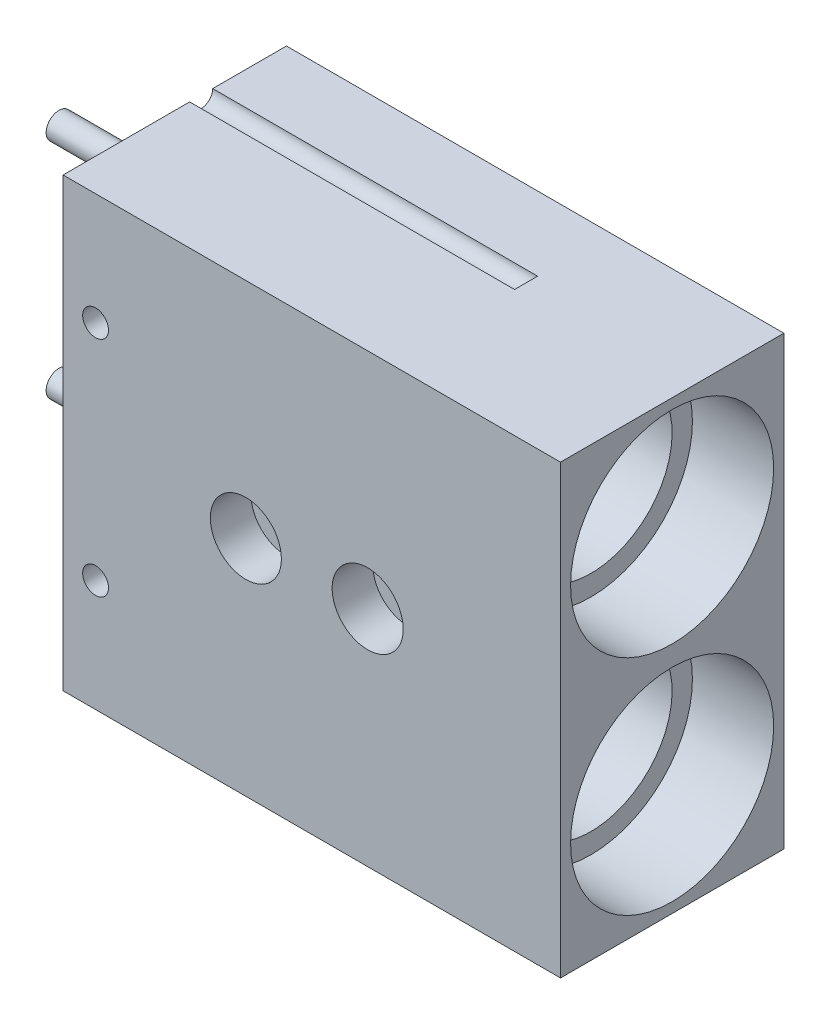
ISO-10303-21;
HEADER;
FILE_DESCRIPTION(('STEP AP214'),'2;1');
FILE_NAME('part.step','',(''),(''),'','','');
FILE_SCHEMA(('AUTOMOTIVE_DESIGN { 1 0 10303 214 1 1 1 1 }'));
ENDSEC;
DATA;
#1=APPLICATION_CONTEXT('core data for automotive mechanical design processes');
#2=APPLICATION_PROTOCOL_DEFINITION('international standard','automotive_design',2000,#1);
#3=PRODUCT_CONTEXT('',#1,'mechanical');
#4=PRODUCT('Part','Part','',(#3));
#5=PRODUCT_RELATED_PRODUCT_CATEGORY('part','',(#4));
#6=PRODUCT_DEFINITION_FORMATION('','',#4);
#7=PRODUCT_DEFINITION_CONTEXT('part definition',#1,'design');
#8=PRODUCT_DEFINITION('design','',#6,#7);
#9=PRODUCT_DEFINITION_SHAPE('','',#8);
#10=(LENGTH_UNIT() NAMED_UNIT(*) SI_UNIT(.MILLI.,.METRE.));
#11=(NAMED_UNIT(*) PLANE_ANGLE_UNIT() SI_UNIT($,.RADIAN.));
#12=(NAMED_UNIT(*) SI_UNIT($,.STERADIAN.) SOLID_ANGLE_UNIT());
#13=UNCERTAINTY_MEASURE_WITH_UNIT(LENGTH_MEASURE(1.E-05),#10,'distance_accuracy_value','');
#14=(GEOMETRIC_REPRESENTATION_CONTEXT(3) GLOBAL_UNCERTAINTY_ASSIGNED_CONTEXT((#13)) GLOBAL_UNIT_ASSIGNED_CONTEXT((#10,
#11,#12)) REPRESENTATION_CONTEXT('',''));
#15=CARTESIAN_POINT('',(0.,0.,0.));
#16=DIRECTION('',(0.,0.,1.));
#17=DIRECTION('',(1.,0.,0.));
#18=AXIS2_PLACEMENT_3D('',#15,#16,#17);
#19=CARTESIAN_POINT('',(-22.5966765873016,15.4214285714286,-34.925));
#20=DIRECTION('',(-1.,0.,0.));
#21=DIRECTION('',(0.,-1.,0.));
#22=AXIS2_PLACEMENT_3D('',#19,#20,#21);
#23=PLANE('',#22);
#24=CARTESIAN_POINT('',(-22.5966765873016,-2.04107142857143,-23.876));
#25=DIRECTION('',(-1.,0.,0.));
#26=DIRECTION('',(0.,-1.,0.));
#27=AXIS2_PLACEMENT_3D('',#24,#25,#26);
#28=CIRCLE('',#27,2.0193);
#29=CARTESIAN_POINT('',(-22.5966765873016,-4.06037142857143,-23.876));
#30=VERTEX_POINT('',#29);
#31=EDGE_CURVE('E179',#30,#30,#28,.T.);
#32=ORIENTED_EDGE('',*,*,#31,.F.);
#33=EDGE_LOOP('',(#32));
#34=FACE_BOUND('',#33,.T.);
#35=CARTESIAN_POINT('',(-22.5966765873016,-54.4285714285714,-21.59));
#36=DIRECTION('',(-1.,0.,0.));
#37=DIRECTION('',(0.,-1.,0.));
#38=AXIS2_PLACEMENT_3D('',#35,#36,#37);
#39=CIRCLE('',#38,1.8034);
#40=CARTESIAN_POINT('',(-22.5966765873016,-54.4285714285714,-19.7866));
#41=VERTEX_POINT('',#40);
#42=CARTESIAN_POINT('',(-22.5966765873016,-54.4285714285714,-23.3934));
#43=VERTEX_POINT('',#42);
#44=EDGE_CURVE('E115',#41,#43,#39,.T.);
#45=ORIENTED_EDGE('',*,*,#44,.F.);
#46=DIRECTION('',(0.,0.,1.));
#47=VECTOR('',#46,1.);
#48=CARTESIAN_POINT('',(-22.5966765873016,-54.4285714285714,-34.925));
#49=LINE('',#48,#47);
#50=CARTESIAN_POINT('',(-22.5966765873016,-54.4285714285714,0.));
#51=VERTEX_POINT('',#50);
#52=EDGE_CURVE('E124',#41,#51,#49,.T.);
#53=ORIENTED_EDGE('',*,*,#52,.T.);
#54=DIRECTION('',(0.,-1.,0.));
#55=VECTOR('',#54,1.);
#56=CARTESIAN_POINT('',(-22.5966765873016,15.4214285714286,0.));
#57=LINE('',#56,#55);
#58=CARTESIAN_POINT('',(-22.5966765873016,15.4214285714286,0.));
#59=VERTEX_POINT('',#58);
#60=EDGE_CURVE('E238',#59,#51,#57,.T.);
#61=ORIENTED_EDGE('',*,*,#60,.F.);
#62=DIRECTION('',(0.,0.,1.));
#63=VECTOR('',#62,1.);
#64=CARTESIAN_POINT('',(-22.5966765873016,15.4214285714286,-34.925));
#65=LINE('',#64,#63);
#66=CARTESIAN_POINT('',(-22.5966765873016,15.4214285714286,-19.7866));
#67=VERTEX_POINT('',#66);
#68=EDGE_CURVE('E255',#67,#59,#65,.T.);
#69=ORIENTED_EDGE('',*,*,#68,.F.);
#70=CARTESIAN_POINT('',(-22.5966765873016,15.4214285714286,-21.59));
#71=DIRECTION('',(-1.,0.,0.));
#72=DIRECTION('',(0.,-1.,0.));
#73=AXIS2_PLACEMENT_3D('',#70,#71,#72);
#74=CIRCLE('',#73,1.8034);
#75=CARTESIAN_POINT('',(-22.5966765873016,15.4214285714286,-23.3934));
#76=VERTEX_POINT('',#75);
#77=EDGE_CURVE('E186',#76,#67,#74,.T.);
#78=ORIENTED_EDGE('',*,*,#77,.F.);
#79=CARTESIAN_POINT('',(-22.5966765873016,15.4214285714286,-34.925));
#80=VERTEX_POINT('',#79);
#81=EDGE_CURVE('E147',#80,#76,#65,.T.);
#82=ORIENTED_EDGE('',*,*,#81,.F.);
#83=DIRECTION('',(0.,-1.,0.));
#84=VECTOR('',#83,1.);
#85=CARTESIAN_POINT('',(-22.5966765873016,15.4214285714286,-34.925));
#86=LINE('',#85,#84);
#87=CARTESIAN_POINT('',(-22.5966765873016,-54.4285714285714,-34.925));
#88=VERTEX_POINT('',#87);
#89=EDGE_CURVE('E239',#80,#88,#86,.T.);
#90=ORIENTED_EDGE('',*,*,#89,.T.);
#91=EDGE_CURVE('E127',#88,#43,#49,.T.);
#92=ORIENTED_EDGE('',*,*,#91,.T.);
#93=EDGE_LOOP('',(#45,#53,#61,#69,#78,#82,#90,#92));
#94=FACE_BOUND('',#93,.T.);
#95=CARTESIAN_POINT('',(-22.5966765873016,-36.9660714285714,-23.876));
#96=DIRECTION('',(-1.,0.,0.));
#97=DIRECTION('',(0.,-1.,0.));
#98=AXIS2_PLACEMENT_3D('',#95,#96,#97);
#99=CIRCLE('',#98,2.0193);
#100=CARTESIAN_POINT('',(-22.5966765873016,-38.9853714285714,-23.876));
#101=VERTEX_POINT('',#100);
#102=EDGE_CURVE('E175',#101,#101,#99,.T.);
#103=ORIENTED_EDGE('',*,*,#102,.F.);
#104=EDGE_LOOP('',(#103));
#105=FACE_BOUND('',#104,.T.);
#106=ADVANCED_FACE('F37',(#34,#94,#105),#23,.T.);
#107=CARTESIAN_POINT('',(-22.5966765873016,15.4214285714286,-34.925));
#108=DIRECTION('',(0.,1.,0.));
#109=DIRECTION('',(0.,0.,1.));
#110=AXIS2_PLACEMENT_3D('',#107,#108,#109);
#111=PLANE('',#110);
#112=DIRECTION('',(-1.,0.,0.));
#113=VECTOR('',#112,1.);
#114=CARTESIAN_POINT('',(28.2033234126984,15.4214285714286,-23.3934));
#115=LINE('',#114,#113);
#116=CARTESIAN_POINT('',(28.2033234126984,15.4214285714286,-23.3934));
#117=VERTEX_POINT('',#116);
#118=EDGE_CURVE('E149',#117,#76,#115,.T.);
#119=ORIENTED_EDGE('',*,*,#118,.F.);
#120=DIRECTION('',(0.,0.,1.));
#121=VECTOR('',#120,1.);
#122=CARTESIAN_POINT('',(28.2033234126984,15.4214285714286,-34.925));
#123=LINE('',#122,#121);
#124=CARTESIAN_POINT('',(28.2033234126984,15.4214285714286,-19.7866));
#125=VERTEX_POINT('',#124);
#126=EDGE_CURVE('E143',#117,#125,#123,.T.);
#127=ORIENTED_EDGE('',*,*,#126,.T.);
#128=DIRECTION('',(-1.,0.,0.));
#129=VECTOR('',#128,1.);
#130=CARTESIAN_POINT('',(28.2033234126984,15.4214285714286,-19.7866));
#131=LINE('',#130,#129);
#132=EDGE_CURVE('E146',#67,#125,#131,.F.);
#133=ORIENTED_EDGE('',*,*,#132,.F.);
#134=ORIENTED_EDGE('',*,*,#68,.T.);
#135=DIRECTION('',(-1.,0.,0.));
#136=VECTOR('',#135,1.);
#137=CARTESIAN_POINT('',(-22.5966765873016,15.4214285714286,0.));
#138=LINE('',#137,#136);
#139=CARTESIAN_POINT('',(55.1781234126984,15.4214285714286,0.));
#140=VERTEX_POINT('',#139);
#141=EDGE_CURVE('E242',#140,#59,#138,.T.);
#142=ORIENTED_EDGE('',*,*,#141,.F.);
#143=DIRECTION('',(0.,0.,1.));
#144=VECTOR('',#143,1.);
#145=CARTESIAN_POINT('',(55.1781234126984,15.4214285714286,-34.925));
#146=LINE('',#145,#144);
#147=CARTESIAN_POINT('',(55.1781234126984,15.4214285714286,-34.925));
#148=VERTEX_POINT('',#147);
#149=EDGE_CURVE('E256',#148,#140,#146,.T.);
#150=ORIENTED_EDGE('',*,*,#149,.F.);
#151=DIRECTION('',(-1.,0.,0.));
#152=VECTOR('',#151,1.);
#153=CARTESIAN_POINT('',(-22.5966765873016,15.4214285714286,-34.925));
#154=LINE('',#153,#152);
#155=EDGE_CURVE('E134',#148,#80,#154,.T.);
#156=ORIENTED_EDGE('',*,*,#155,.T.);
#157=ORIENTED_EDGE('',*,*,#81,.T.);
#158=EDGE_LOOP('',(#119,#127,#133,#134,#142,#150,#156,#157));
#159=FACE_BOUND('',#158,.T.);
#160=ADVANCED_FACE('F270',(#159),#111,.T.);
#161=CARTESIAN_POINT('',(55.1781234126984,15.4214285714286,-34.925));
#162=DIRECTION('',(1.,0.,0.));
#163=DIRECTION('',(0.,1.,0.));
#164=AXIS2_PLACEMENT_3D('',#161,#162,#163);
#165=PLANE('',#164);
#166=CARTESIAN_POINT('',(55.1781234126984,-36.9533714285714,-17.4498));
#167=DIRECTION('',(1.,0.,0.));
#168=DIRECTION('',(0.,1.,0.));
#169=AXIS2_PLACEMENT_3D('',#166,#167,#168);
#170=CIRCLE('',#169,15.875);
#171=CARTESIAN_POINT('',(55.1781234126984,-21.0783714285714,-17.4498));
#172=VERTEX_POINT('',#171);
#173=EDGE_CURVE('E170',#172,#172,#170,.T.);
#174=ORIENTED_EDGE('',*,*,#173,.F.);
#175=EDGE_LOOP('',(#174));
#176=FACE_BOUND('',#175,.T.);
#177=CARTESIAN_POINT('',(55.1781234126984,-2.05377142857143,-17.4498));
#178=DIRECTION('',(1.,0.,0.));
#179=DIRECTION('',(0.,1.,0.));
#180=AXIS2_PLACEMENT_3D('',#177,#178,#179);
#181=CIRCLE('',#180,15.875);
#182=CARTESIAN_POINT('',(55.1781234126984,13.8212285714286,-17.4498));
#183=VERTEX_POINT('',#182);
#184=EDGE_CURVE('E163',#183,#183,#181,.T.);
#185=ORIENTED_EDGE('',*,*,#184,.F.);
#186=EDGE_LOOP('',(#185));
#187=FACE_BOUND('',#186,.T.);
#188=DIRECTION('',(0.,1.,0.));
#189=VECTOR('',#188,1.);
#190=CARTESIAN_POINT('',(55.1781234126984,15.4214285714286,0.));
#191=LINE('',#190,#189);
#192=CARTESIAN_POINT('',(55.1781234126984,-54.4285714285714,0.));
#193=VERTEX_POINT('',#192);
#194=EDGE_CURVE('E249',#193,#140,#191,.T.);
#195=ORIENTED_EDGE('',*,*,#194,.F.);
#196=DIRECTION('',(0.,0.,1.));
#197=VECTOR('',#196,1.);
#198=CARTESIAN_POINT('',(55.1781234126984,-54.4285714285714,-34.925));
#199=LINE('',#198,#197);
#200=CARTESIAN_POINT('',(55.1781234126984,-54.4285714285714,-34.925));
#201=VERTEX_POINT('',#200);
#202=EDGE_CURVE('E136',#201,#193,#199,.T.);
#203=ORIENTED_EDGE('',*,*,#202,.F.);
#204=DIRECTION('',(0.,1.,0.));
#205=VECTOR('',#204,1.);
#206=CARTESIAN_POINT('',(55.1781234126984,15.4214285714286,-34.925));
#207=LINE('',#206,#205);
#208=EDGE_CURVE('E138',#201,#148,#207,.T.);
#209=ORIENTED_EDGE('',*,*,#208,.T.);
#210=ORIENTED_EDGE('',*,*,#149,.T.);
#211=EDGE_LOOP('',(#195,#203,#209,#210));
#212=FACE_BOUND('',#211,.T.);
#213=ADVANCED_FACE('F261',(#176,#187,#212),#165,.T.);
#214=CARTESIAN_POINT('',(-22.5966765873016,-54.4285714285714,-34.925));
#215=DIRECTION('',(0.,-1.,0.));
#216=DIRECTION('',(0.,0.,-1.));
#217=AXIS2_PLACEMENT_3D('',#214,#215,#216);
#218=PLANE('',#217);
#219=DIRECTION('',(-1.,0.,0.));
#220=VECTOR('',#219,1.);
#221=CARTESIAN_POINT('',(28.2033234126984,-54.4285714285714,-19.7866));
#222=LINE('',#221,#220);
#223=CARTESIAN_POINT('',(28.2033234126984,-54.4285714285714,-19.7866));
#224=VERTEX_POINT('',#223);
#225=EDGE_CURVE('E11',#224,#41,#222,.T.);
#226=ORIENTED_EDGE('',*,*,#225,.F.);
#227=DIRECTION('',(0.,0.,-1.));
#228=VECTOR('',#227,1.);
#229=CARTESIAN_POINT('',(28.2033234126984,-54.4285714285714,-34.925));
#230=LINE('',#229,#228);
#231=CARTESIAN_POINT('',(28.2033234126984,-54.4285714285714,-23.3934));
#232=VERTEX_POINT('',#231);
#233=EDGE_CURVE('E151',#224,#232,#230,.T.);
#234=ORIENTED_EDGE('',*,*,#233,.T.);
#235=DIRECTION('',(-1.,0.,0.));
#236=VECTOR('',#235,1.);
#237=CARTESIAN_POINT('',(28.2033234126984,-54.4285714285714,-23.3934));
#238=LINE('',#237,#236);
#239=EDGE_CURVE('E45',#43,#232,#238,.F.);
#240=ORIENTED_EDGE('',*,*,#239,.F.);
#241=ORIENTED_EDGE('',*,*,#91,.F.);
#242=DIRECTION('',(1.,0.,0.));
#243=VECTOR('',#242,1.);
#244=CARTESIAN_POINT('',(-22.5966765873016,-54.4285714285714,-34.925));
#245=LINE('',#244,#243);
#246=EDGE_CURVE('E241',#88,#201,#245,.T.);
#247=ORIENTED_EDGE('',*,*,#246,.T.);
#248=ORIENTED_EDGE('',*,*,#202,.T.);
#249=DIRECTION('',(1.,0.,0.));
#250=VECTOR('',#249,1.);
#251=CARTESIAN_POINT('',(-22.5966765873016,-54.4285714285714,0.));
#252=LINE('',#251,#250);
#253=EDGE_CURVE('E132',#51,#193,#252,.T.);
#254=ORIENTED_EDGE('',*,*,#253,.F.);
#255=ORIENTED_EDGE('',*,*,#52,.F.);
#256=EDGE_LOOP('',(#226,#234,#240,#241,#247,#248,#254,#255));
#257=FACE_BOUND('',#256,.T.);
#258=ADVANCED_FACE('F130',(#257),#218,.T.);
#259=CARTESIAN_POINT('',(-22.5966765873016,-54.4285714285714,-34.925));
#260=DIRECTION('',(0.,0.,1.));
#261=DIRECTION('',(1.,0.,0.));
#262=AXIS2_PLACEMENT_3D('',#259,#260,#261);
#263=PLANE('',#262);
#264=CARTESIAN_POINT('',(15.5033234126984,-51.2535714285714,-34.925));
#265=DIRECTION('',(0.,0.,-1.));
#266=DIRECTION('',(-1.,0.,0.));
#267=AXIS2_PLACEMENT_3D('',#264,#265,#266);
#268=CIRCLE('',#267,2.38124999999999);
#269=CARTESIAN_POINT('',(13.1220734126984,-51.2535714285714,-34.925));
#270=VERTEX_POINT('',#269);
#271=EDGE_CURVE('E189',#270,#270,#268,.T.);
#272=ORIENTED_EDGE('',*,*,#271,.F.);
#273=EDGE_LOOP('',(#272));
#274=FACE_BOUND('',#273,.T.);
#275=CARTESIAN_POINT('',(15.5033234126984,12.2464285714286,-34.925));
#276=DIRECTION('',(0.,0.,-1.));
#277=DIRECTION('',(-1.,0.,0.));
#278=AXIS2_PLACEMENT_3D('',#275,#276,#277);
#279=CIRCLE('',#278,2.38125);
#280=CARTESIAN_POINT('',(13.1220734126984,12.2464285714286,-34.925));
#281=VERTEX_POINT('',#280);
#282=EDGE_CURVE('E199',#281,#281,#279,.T.);
#283=ORIENTED_EDGE('',*,*,#282,.F.);
#284=EDGE_LOOP('',(#283));
#285=FACE_BOUND('',#284,.T.);
#286=CARTESIAN_POINT('',(25.0283234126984,-19.5035714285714,-34.925));
#287=DIRECTION('',(0.,0.,1.));
#288=DIRECTION('',(1.,0.,0.));
#289=AXIS2_PLACEMENT_3D('',#286,#287,#288);
#290=CIRCLE('',#289,3.37819999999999);
#291=CARTESIAN_POINT('',(28.4065234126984,-19.5035714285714,-34.925));
#292=VERTEX_POINT('',#291);
#293=EDGE_CURVE('E202',#292,#292,#290,.T.);
#294=ORIENTED_EDGE('',*,*,#293,.T.);
#295=EDGE_LOOP('',(#294));
#296=FACE_BOUND('',#295,.T.);
#297=CARTESIAN_POINT('',(5.97832341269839,-19.5035714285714,-34.925));
#298=DIRECTION('',(0.,0.,1.));
#299=DIRECTION('',(1.,0.,0.));
#300=AXIS2_PLACEMENT_3D('',#297,#298,#299);
#301=CIRCLE('',#300,3.37819999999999);
#302=CARTESIAN_POINT('',(9.35652341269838,-19.5035714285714,-34.925));
#303=VERTEX_POINT('',#302);
#304=EDGE_CURVE('E223',#303,#303,#301,.T.);
#305=ORIENTED_EDGE('',*,*,#304,.T.);
#306=EDGE_LOOP('',(#305));
#307=FACE_BOUND('',#306,.T.);
#308=ORIENTED_EDGE('',*,*,#89,.F.);
#309=ORIENTED_EDGE('',*,*,#155,.F.);
#310=ORIENTED_EDGE('',*,*,#208,.F.);
#311=ORIENTED_EDGE('',*,*,#246,.F.);
#312=EDGE_LOOP('',(#308,#309,#310,#311));
#313=FACE_BOUND('',#312,.T.);
#314=ADVANCED_FACE('F276',(#274,#285,#296,#307,#313),#263,.F.);
#315=CARTESIAN_POINT('',(-22.5966765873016,-54.4285714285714,0.));
#316=DIRECTION('',(0.,0.,1.));
#317=DIRECTION('',(1.,0.,0.));
#318=AXIS2_PLACEMENT_3D('',#315,#316,#317);
#319=PLANE('',#318);
#320=CARTESIAN_POINT('',(25.0283234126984,-19.5035714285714,0.));
#321=DIRECTION('',(0.,0.,1.));
#322=DIRECTION('',(1.,0.,0.));
#323=AXIS2_PLACEMENT_3D('',#320,#321,#322);
#324=CIRCLE('',#323,5.55625);
#325=CARTESIAN_POINT('',(30.5845734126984,-19.5035714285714,0.));
#326=VERTEX_POINT('',#325);
#327=EDGE_CURVE('E211',#326,#326,#324,.T.);
#328=ORIENTED_EDGE('',*,*,#327,.F.);
#329=EDGE_LOOP('',(#328));
#330=FACE_BOUND('',#329,.T.);
#331=CARTESIAN_POINT('',(5.97832341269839,-19.5035714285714,0.));
#332=DIRECTION('',(0.,0.,1.));
#333=DIRECTION('',(1.,0.,0.));
#334=AXIS2_PLACEMENT_3D('',#331,#332,#333);
#335=CIRCLE('',#334,5.55625);
#336=CARTESIAN_POINT('',(11.5345734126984,-19.5035714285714,0.));
#337=VERTEX_POINT('',#336);
#338=EDGE_CURVE('E214',#337,#337,#335,.T.);
#339=ORIENTED_EDGE('',*,*,#338,.F.);
#340=EDGE_LOOP('',(#339));
#341=FACE_BOUND('',#340,.T.);
#342=CARTESIAN_POINT('',(-17.5166765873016,-36.9533714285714,0.));
#343=DIRECTION('',(0.,0.,1.));
#344=DIRECTION('',(1.,0.,0.));
#345=AXIS2_PLACEMENT_3D('',#342,#343,#344);
#346=CIRCLE('',#345,2.01929999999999);
#347=CARTESIAN_POINT('',(-15.4973765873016,-36.9533714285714,0.));
#348=VERTEX_POINT('',#347);
#349=EDGE_CURVE('E229',#348,#348,#346,.T.);
#350=ORIENTED_EDGE('',*,*,#349,.F.);
#351=EDGE_LOOP('',(#350));
#352=FACE_BOUND('',#351,.T.);
#353=CARTESIAN_POINT('',(-17.5166765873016,-2.05377142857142,0.));
#354=DIRECTION('',(0.,0.,1.));
#355=DIRECTION('',(1.,0.,0.));
#356=AXIS2_PLACEMENT_3D('',#353,#354,#355);
#357=CIRCLE('',#356,2.0193);
#358=CARTESIAN_POINT('',(-15.4973765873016,-2.05377142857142,0.));
#359=VERTEX_POINT('',#358);
#360=EDGE_CURVE('E235',#359,#359,#357,.T.);
#361=ORIENTED_EDGE('',*,*,#360,.F.);
#362=EDGE_LOOP('',(#361));
#363=FACE_BOUND('',#362,.T.);
#364=ORIENTED_EDGE('',*,*,#60,.T.);
#365=ORIENTED_EDGE('',*,*,#253,.T.);
#366=ORIENTED_EDGE('',*,*,#194,.T.);
#367=ORIENTED_EDGE('',*,*,#141,.T.);
#368=EDGE_LOOP('',(#364,#365,#366,#367));
#369=FACE_BOUND('',#368,.T.);
#370=ADVANCED_FACE('F264',(#330,#341,#352,#363,#369),#319,.T.);
#371=CARTESIAN_POINT('',(-17.5166765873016,-2.05377142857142,0.));
#372=DIRECTION('',(0.,0.,1.));
#373=DIRECTION('',(1.,0.,0.));
#374=AXIS2_PLACEMENT_3D('',#371,#372,#373);
#375=CYLINDRICAL_SURFACE('',#374,2.0193);
#376=CARTESIAN_POINT('',(-17.5166765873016,-2.05377142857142,-12.0396));
#377=DIRECTION('',(0.,0.,1.));
#378=DIRECTION('',(1.,0.,0.));
#379=AXIS2_PLACEMENT_3D('',#376,#377,#378);
#380=CIRCLE('',#379,2.01929999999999);
#381=CARTESIAN_POINT('',(-15.4973765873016,-2.05377142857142,-12.0396));
#382=VERTEX_POINT('',#381);
#383=EDGE_CURVE('E232',#382,#382,#380,.T.);
#384=ORIENTED_EDGE('',*,*,#383,.F.);
#385=EDGE_LOOP('',(#384));
#386=FACE_BOUND('',#385,.T.);
#387=ORIENTED_EDGE('',*,*,#360,.T.);
#388=EDGE_LOOP('',(#387));
#389=FACE_BOUND('',#388,.T.);
#390=ADVANCED_FACE('F284',(#386,#389),#375,.F.);
#391=CARTESIAN_POINT('',(-17.5166765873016,-2.05377142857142,-12.0396));
#392=DIRECTION('',(0.,0.,1.));
#393=DIRECTION('',(1.,0.,0.));
#394=AXIS2_PLACEMENT_3D('',#391,#392,#393);
#395=CONICAL_SURFACE('',#394,2.01929999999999,1.02974425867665);
#396=CARTESIAN_POINT('',(-17.5166765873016,-2.05377142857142,-13.2529178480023));
#397=VERTEX_POINT('',#396);
#398=VERTEX_LOOP('',#397);
#399=FACE_BOUND('',#398,.T.);
#400=ORIENTED_EDGE('',*,*,#383,.T.);
#401=EDGE_LOOP('',(#400));
#402=FACE_BOUND('',#401,.T.);
#403=ADVANCED_FACE('F369',(#399,#402),#395,.F.);
#404=CARTESIAN_POINT('',(-17.5166765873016,-36.9533714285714,0.));
#405=DIRECTION('',(0.,0.,1.));
#406=DIRECTION('',(1.,0.,0.));
#407=AXIS2_PLACEMENT_3D('',#404,#405,#406);
#408=CYLINDRICAL_SURFACE('',#407,2.01929999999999);
#409=CARTESIAN_POINT('',(-17.5166765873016,-36.9533714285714,-12.0396));
#410=DIRECTION('',(0.,0.,1.));
#411=DIRECTION('',(1.,0.,0.));
#412=AXIS2_PLACEMENT_3D('',#409,#410,#411);
#413=CIRCLE('',#412,2.01929999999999);
#414=CARTESIAN_POINT('',(-15.4973765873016,-36.9533714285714,-12.0396));
#415=VERTEX_POINT('',#414);
#416=EDGE_CURVE('E226',#415,#415,#413,.T.);
#417=ORIENTED_EDGE('',*,*,#416,.F.);
#418=EDGE_LOOP('',(#417));
#419=FACE_BOUND('',#418,.T.);
#420=ORIENTED_EDGE('',*,*,#349,.T.);
#421=EDGE_LOOP('',(#420));
#422=FACE_BOUND('',#421,.T.);
#423=ADVANCED_FACE('F365',(#419,#422),#408,.F.);
#424=CARTESIAN_POINT('',(-17.5166765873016,-36.9533714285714,-12.0396));
#425=DIRECTION('',(0.,0.,1.));
#426=DIRECTION('',(1.,0.,0.));
#427=AXIS2_PLACEMENT_3D('',#424,#425,#426);
#428=CONICAL_SURFACE('',#427,2.01929999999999,1.02974425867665);
#429=CARTESIAN_POINT('',(-17.5166765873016,-36.9533714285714,-13.2529178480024));
#430=VERTEX_POINT('',#429);
#431=VERTEX_LOOP('',#430);
#432=FACE_BOUND('',#431,.T.);
#433=ORIENTED_EDGE('',*,*,#416,.T.);
#434=EDGE_LOOP('',(#433));
#435=FACE_BOUND('',#434,.T.);
#436=ADVANCED_FACE('F361',(#432,#435),#428,.F.);
#437=CARTESIAN_POINT('',(5.97832341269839,-19.5035714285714,0.));
#438=DIRECTION('',(0.,0.,1.));
#439=DIRECTION('',(1.,0.,0.));
#440=AXIS2_PLACEMENT_3D('',#437,#438,#439);
#441=CYLINDRICAL_SURFACE('',#440,3.3782);
#442=ORIENTED_EDGE('',*,*,#304,.F.);
#443=EDGE_LOOP('',(#442));
#444=FACE_BOUND('',#443,.T.);
#445=CARTESIAN_POINT('',(5.97832341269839,-19.5035714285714,-6.35));
#446=DIRECTION('',(0.,0.,1.));
#447=DIRECTION('',(1.,0.,0.));
#448=AXIS2_PLACEMENT_3D('',#445,#446,#447);
#449=CIRCLE('',#448,3.3782);
#450=CARTESIAN_POINT('',(9.3565234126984,-19.5035714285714,-6.35));
#451=VERTEX_POINT('',#450);
#452=EDGE_CURVE('E220',#451,#451,#449,.T.);
#453=ORIENTED_EDGE('',*,*,#452,.T.);
#454=EDGE_LOOP('',(#453));
#455=FACE_BOUND('',#454,.T.);
#456=ADVANCED_FACE('F357',(#444,#455),#441,.F.);
#457=CARTESIAN_POINT('',(9.3565234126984,-19.5035714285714,-6.35));
#458=DIRECTION('',(0.,0.,-1.));
#459=DIRECTION('',(-1.,0.,0.));
#460=AXIS2_PLACEMENT_3D('',#457,#458,#459);
#461=PLANE('',#460);
#462=ORIENTED_EDGE('',*,*,#452,.F.);
#463=EDGE_LOOP('',(#462));
#464=FACE_BOUND('',#463,.T.);
#465=CARTESIAN_POINT('',(5.97832341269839,-19.5035714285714,-6.35));
#466=DIRECTION('',(0.,0.,1.));
#467=DIRECTION('',(1.,0.,0.));
#468=AXIS2_PLACEMENT_3D('',#465,#466,#467);
#469=CIRCLE('',#468,5.55625);
#470=CARTESIAN_POINT('',(11.5345734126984,-19.5035714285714,-6.35));
#471=VERTEX_POINT('',#470);
#472=EDGE_CURVE('E217',#471,#471,#469,.T.);
#473=ORIENTED_EDGE('',*,*,#472,.T.);
#474=EDGE_LOOP('',(#473));
#475=FACE_BOUND('',#474,.T.);
#476=ADVANCED_FACE('F353',(#464,#475),#461,.F.);
#477=CARTESIAN_POINT('',(5.97832341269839,-19.5035714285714,0.));
#478=DIRECTION('',(0.,0.,1.));
#479=DIRECTION('',(1.,0.,0.));
#480=AXIS2_PLACEMENT_3D('',#477,#478,#479);
#481=CYLINDRICAL_SURFACE('',#480,5.55625);
#482=ORIENTED_EDGE('',*,*,#472,.F.);
#483=EDGE_LOOP('',(#482));
#484=FACE_BOUND('',#483,.T.);
#485=ORIENTED_EDGE('',*,*,#338,.T.);
#486=EDGE_LOOP('',(#485));
#487=FACE_BOUND('',#486,.T.);
#488=ADVANCED_FACE('F349',(#484,#487),#481,.F.);
#489=CARTESIAN_POINT('',(25.0283234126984,-19.5035714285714,0.));
#490=DIRECTION('',(0.,0.,1.));
#491=DIRECTION('',(1.,0.,0.));
#492=AXIS2_PLACEMENT_3D('',#489,#490,#491);
#493=CYLINDRICAL_SURFACE('',#492,5.55625);
#494=CARTESIAN_POINT('',(25.0283234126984,-19.5035714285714,-6.35));
#495=DIRECTION('',(0.,0.,1.));
#496=DIRECTION('',(1.,0.,0.));
#497=AXIS2_PLACEMENT_3D('',#494,#495,#496);
#498=CIRCLE('',#497,5.55625);
#499=CARTESIAN_POINT('',(30.5845734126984,-19.5035714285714,-6.35));
#500=VERTEX_POINT('',#499);
#501=EDGE_CURVE('E208',#500,#500,#498,.T.);
#502=ORIENTED_EDGE('',*,*,#501,.F.);
#503=EDGE_LOOP('',(#502));
#504=FACE_BOUND('',#503,.T.);
#505=ORIENTED_EDGE('',*,*,#327,.T.);
#506=EDGE_LOOP('',(#505));
#507=FACE_BOUND('',#506,.T.);
#508=ADVANCED_FACE('F345',(#504,#507),#493,.F.);
#509=CARTESIAN_POINT('',(28.4065234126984,-19.5035714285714,-6.35));
#510=DIRECTION('',(0.,0.,-1.));
#511=DIRECTION('',(-1.,0.,0.));
#512=AXIS2_PLACEMENT_3D('',#509,#510,#511);
#513=PLANE('',#512);
#514=CARTESIAN_POINT('',(25.0283234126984,-19.5035714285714,-6.35));
#515=DIRECTION('',(0.,0.,1.));
#516=DIRECTION('',(1.,0.,0.));
#517=AXIS2_PLACEMENT_3D('',#514,#515,#516);
#518=CIRCLE('',#517,3.37820000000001);
#519=CARTESIAN_POINT('',(28.4065234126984,-19.5035714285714,-6.35));
#520=VERTEX_POINT('',#519);
#521=EDGE_CURVE('E205',#520,#520,#518,.T.);
#522=ORIENTED_EDGE('',*,*,#521,.F.);
#523=EDGE_LOOP('',(#522));
#524=FACE_BOUND('',#523,.T.);
#525=ORIENTED_EDGE('',*,*,#501,.T.);
#526=EDGE_LOOP('',(#525));
#527=FACE_BOUND('',#526,.T.);
#528=ADVANCED_FACE('F341',(#524,#527),#513,.F.);
#529=CARTESIAN_POINT('',(25.0283234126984,-19.5035714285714,0.));
#530=DIRECTION('',(0.,0.,1.));
#531=DIRECTION('',(1.,0.,0.));
#532=AXIS2_PLACEMENT_3D('',#529,#530,#531);
#533=CYLINDRICAL_SURFACE('',#532,3.3782);
#534=ORIENTED_EDGE('',*,*,#293,.F.);
#535=EDGE_LOOP('',(#534));
#536=FACE_BOUND('',#535,.T.);
#537=ORIENTED_EDGE('',*,*,#521,.T.);
#538=EDGE_LOOP('',(#537));
#539=FACE_BOUND('',#538,.T.);
#540=ADVANCED_FACE('F337',(#536,#539),#533,.F.);
#541=CARTESIAN_POINT('',(15.5033234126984,12.2464285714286,-34.925));
#542=DIRECTION('',(0.,0.,-1.));
#543=DIRECTION('',(-1.,0.,0.));
#544=AXIS2_PLACEMENT_3D('',#541,#542,#543);
#545=CYLINDRICAL_SURFACE('',#544,2.38125);
#546=CARTESIAN_POINT('',(15.5033234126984,12.2464285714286,-28.575));
#547=DIRECTION('',(0.,0.,-1.));
#548=DIRECTION('',(-1.,0.,0.));
#549=AXIS2_PLACEMENT_3D('',#546,#547,#548);
#550=CIRCLE('',#549,2.38124999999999);
#551=CARTESIAN_POINT('',(13.1220734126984,12.2464285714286,-28.575));
#552=VERTEX_POINT('',#551);
#553=EDGE_CURVE('E196',#552,#552,#550,.T.);
#554=ORIENTED_EDGE('',*,*,#553,.F.);
#555=EDGE_LOOP('',(#554));
#556=FACE_BOUND('',#555,.T.);
#557=ORIENTED_EDGE('',*,*,#282,.T.);
#558=EDGE_LOOP('',(#557));
#559=FACE_BOUND('',#558,.T.);
#560=ADVANCED_FACE('F333',(#556,#559),#545,.F.);
#561=CARTESIAN_POINT('',(15.5033234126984,12.2464285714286,-28.575));
#562=DIRECTION('',(0.,0.,-1.));
#563=DIRECTION('',(-1.,0.,0.));
#564=AXIS2_PLACEMENT_3D('',#561,#562,#563);
#565=CONICAL_SURFACE('',#564,2.38124999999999,1.02974425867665);
#566=CARTESIAN_POINT('',(15.5033234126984,12.2464285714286,-27.1442006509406));
#567=VERTEX_POINT('',#566);
#568=VERTEX_LOOP('',#567);
#569=FACE_BOUND('',#568,.T.);
#570=ORIENTED_EDGE('',*,*,#553,.T.);
#571=EDGE_LOOP('',(#570));
#572=FACE_BOUND('',#571,.T.);
#573=ADVANCED_FACE('F329',(#569,#572),#565,.F.);
#574=CARTESIAN_POINT('',(15.5033234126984,-51.2535714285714,-28.575));
#575=DIRECTION('',(0.,0.,-1.));
#576=DIRECTION('',(-1.,0.,0.));
#577=AXIS2_PLACEMENT_3D('',#574,#575,#576);
#578=CONICAL_SURFACE('',#577,2.38124999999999,1.02974425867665);
#579=CARTESIAN_POINT('',(15.5033234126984,-51.2535714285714,-27.1442006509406));
#580=VERTEX_POINT('',#579);
#581=VERTEX_LOOP('',#580);
#582=FACE_BOUND('',#581,.T.);
#583=CARTESIAN_POINT('',(15.5033234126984,-51.2535714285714,-28.575));
#584=DIRECTION('',(0.,0.,-1.));
#585=DIRECTION('',(-1.,0.,0.));
#586=AXIS2_PLACEMENT_3D('',#583,#584,#585);
#587=CIRCLE('',#586,2.38124999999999);
#588=CARTESIAN_POINT('',(13.1220734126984,-51.2535714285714,-28.575));
#589=VERTEX_POINT('',#588);
#590=EDGE_CURVE('E193',#589,#589,#587,.T.);
#591=ORIENTED_EDGE('',*,*,#590,.T.);
#592=EDGE_LOOP('',(#591));
#593=FACE_BOUND('',#592,.T.);
#594=ADVANCED_FACE('F325',(#582,#593),#578,.F.);
#595=CARTESIAN_POINT('',(15.5033234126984,-51.2535714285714,-34.925));
#596=DIRECTION('',(0.,0.,-1.));
#597=DIRECTION('',(-1.,0.,0.));
#598=AXIS2_PLACEMENT_3D('',#595,#596,#597);
#599=CYLINDRICAL_SURFACE('',#598,2.38124999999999);
#600=ORIENTED_EDGE('',*,*,#590,.F.);
#601=EDGE_LOOP('',(#600));
#602=FACE_BOUND('',#601,.T.);
#603=ORIENTED_EDGE('',*,*,#271,.T.);
#604=EDGE_LOOP('',(#603));
#605=FACE_BOUND('',#604,.T.);
#606=ADVANCED_FACE('F322',(#602,#605),#599,.F.);
#607=CARTESIAN_POINT('',(28.2033234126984,15.4214285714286,-21.59));
#608=DIRECTION('',(-1.,0.,0.));
#609=DIRECTION('',(0.,-1.,0.));
#610=AXIS2_PLACEMENT_3D('',#607,#608,#609);
#611=CYLINDRICAL_SURFACE('',#610,1.8034);
#612=ORIENTED_EDGE('',*,*,#118,.T.);
#613=ORIENTED_EDGE('',*,*,#77,.T.);
#614=ORIENTED_EDGE('',*,*,#132,.T.);
#615=CARTESIAN_POINT('',(28.2033234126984,15.4214285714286,-21.59));
#616=DIRECTION('',(-1.,0.,0.));
#617=DIRECTION('',(0.,-1.,0.));
#618=AXIS2_PLACEMENT_3D('',#615,#616,#617);
#619=CIRCLE('',#618,1.8034);
#620=EDGE_CURVE('E59',#117,#125,#619,.T.);
#621=ORIENTED_EDGE('',*,*,#620,.F.);
#622=EDGE_LOOP('',(#612,#613,#614,#621));
#623=FACE_BOUND('',#622,.T.);
#624=ADVANCED_FACE('F272',(#623),#611,.F.);
#625=CARTESIAN_POINT('',(28.2033234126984,15.4214285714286,-21.59));
#626=DIRECTION('',(-1.,0.,0.));
#627=DIRECTION('',(0.,-1.,0.));
#628=AXIS2_PLACEMENT_3D('',#625,#626,#627);
#629=PLANE('',#628);
#630=ORIENTED_EDGE('',*,*,#620,.T.);
#631=ORIENTED_EDGE('',*,*,#126,.F.);
#632=EDGE_LOOP('',(#630,#631));
#633=FACE_BOUND('',#632,.T.);
#634=ADVANCED_FACE('F317',(#633),#629,.T.);
#635=CARTESIAN_POINT('',(28.2033234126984,-54.4285714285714,-21.59));
#636=DIRECTION('',(-1.,0.,0.));
#637=DIRECTION('',(0.,-1.,0.));
#638=AXIS2_PLACEMENT_3D('',#635,#636,#637);
#639=CYLINDRICAL_SURFACE('',#638,1.8034);
#640=ORIENTED_EDGE('',*,*,#225,.T.);
#641=ORIENTED_EDGE('',*,*,#44,.T.);
#642=ORIENTED_EDGE('',*,*,#239,.T.);
#643=CARTESIAN_POINT('',(28.2033234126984,-54.4285714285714,-21.59));
#644=DIRECTION('',(-1.,0.,0.));
#645=DIRECTION('',(0.,-1.,0.));
#646=AXIS2_PLACEMENT_3D('',#643,#644,#645);
#647=CIRCLE('',#646,1.8034);
#648=EDGE_CURVE('E52',#224,#232,#647,.T.);
#649=ORIENTED_EDGE('',*,*,#648,.F.);
#650=EDGE_LOOP('',(#640,#641,#642,#649));
#651=FACE_BOUND('',#650,.T.);
#652=ADVANCED_FACE('F114',(#651),#639,.F.);
#653=CARTESIAN_POINT('',(28.2033234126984,-54.4285714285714,-21.59));
#654=DIRECTION('',(-1.,0.,0.));
#655=DIRECTION('',(0.,-1.,0.));
#656=AXIS2_PLACEMENT_3D('',#653,#654,#655);
#657=PLANE('',#656);
#658=ORIENTED_EDGE('',*,*,#648,.T.);
#659=ORIENTED_EDGE('',*,*,#233,.F.);
#660=EDGE_LOOP('',(#658,#659));
#661=FACE_BOUND('',#660,.T.);
#662=ADVANCED_FACE('F301',(#661),#657,.T.);
#663=CARTESIAN_POINT('',(-47.1076765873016,-2.04107142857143,-23.876));
#664=DIRECTION('',(1.,0.,0.));
#665=DIRECTION('',(0.,1.,0.));
#666=AXIS2_PLACEMENT_3D('',#663,#664,#665);
#667=CYLINDRICAL_SURFACE('',#666,2.0193);
#668=CARTESIAN_POINT('',(-47.1076765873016,-2.04107142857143,-23.876));
#669=DIRECTION('',(-1.,0.,0.));
#670=DIRECTION('',(0.,-1.,0.));
#671=AXIS2_PLACEMENT_3D('',#668,#669,#670);
#672=CIRCLE('',#671,2.0193);
#673=CARTESIAN_POINT('',(-47.1076765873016,-4.06037142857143,-23.876));
#674=VERTEX_POINT('',#673);
#675=EDGE_CURVE('E128',#674,#674,#672,.T.);
#676=ORIENTED_EDGE('',*,*,#675,.F.);
#677=EDGE_LOOP('',(#676));
#678=FACE_BOUND('',#677,.T.);
#679=ORIENTED_EDGE('',*,*,#31,.T.);
#680=EDGE_LOOP('',(#679));
#681=FACE_BOUND('',#680,.T.);
#682=ADVANCED_FACE('F298',(#678,#681),#667,.T.);
#683=CARTESIAN_POINT('',(-47.1076765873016,-2.04107142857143,-23.876));
#684=DIRECTION('',(-1.,0.,0.));
#685=DIRECTION('',(0.,-1.,0.));
#686=AXIS2_PLACEMENT_3D('',#683,#684,#685);
#687=PLANE('',#686);
#688=ORIENTED_EDGE('',*,*,#675,.T.);
#689=EDGE_LOOP('',(#688));
#690=FACE_BOUND('',#689,.T.);
#691=ADVANCED_FACE('F300',(#690),#687,.T.);
#692=CARTESIAN_POINT('',(-47.1076765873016,-36.9660714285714,-23.876));
#693=DIRECTION('',(1.,0.,0.));
#694=DIRECTION('',(0.,1.,0.));
#695=AXIS2_PLACEMENT_3D('',#692,#693,#694);
#696=CYLINDRICAL_SURFACE('',#695,2.0193);
#697=CARTESIAN_POINT('',(-47.1076765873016,-36.9660714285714,-23.876));
#698=DIRECTION('',(-1.,0.,0.));
#699=DIRECTION('',(0.,-1.,0.));
#700=AXIS2_PLACEMENT_3D('',#697,#698,#699);
#701=CIRCLE('',#700,2.0193);
#702=CARTESIAN_POINT('',(-47.1076765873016,-38.9853714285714,-23.876));
#703=VERTEX_POINT('',#702);
#704=EDGE_CURVE('E176',#703,#703,#701,.T.);
#705=ORIENTED_EDGE('',*,*,#704,.F.);
#706=EDGE_LOOP('',(#705));
#707=FACE_BOUND('',#706,.T.);
#708=ORIENTED_EDGE('',*,*,#102,.T.);
#709=EDGE_LOOP('',(#708));
#710=FACE_BOUND('',#709,.T.);
#711=ADVANCED_FACE('F308',(#707,#710),#696,.T.);
#712=CARTESIAN_POINT('',(-47.1076765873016,-36.9660714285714,-23.876));
#713=DIRECTION('',(-1.,0.,0.));
#714=DIRECTION('',(0.,-1.,0.));
#715=AXIS2_PLACEMENT_3D('',#712,#713,#714);
#716=PLANE('',#715);
#717=ORIENTED_EDGE('',*,*,#704,.T.);
#718=EDGE_LOOP('',(#717));
#719=FACE_BOUND('',#718,.T.);
#720=ADVANCED_FACE('F479',(#719),#716,.T.);
#721=CARTESIAN_POINT('',(42.4781234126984,-2.05377142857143,-17.4498));
#722=DIRECTION('',(1.,0.,0.));
#723=DIRECTION('',(0.,1.,0.));
#724=AXIS2_PLACEMENT_3D('',#721,#722,#723);
#725=PLANE('',#724);
#726=CARTESIAN_POINT('',(42.4781234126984,-2.05377142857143,-17.4498));
#727=DIRECTION('',(1.,0.,0.));
#728=DIRECTION('',(0.,1.,0.));
#729=AXIS2_PLACEMENT_3D('',#726,#727,#728);
#730=CIRCLE('',#729,15.875);
#731=CARTESIAN_POINT('',(42.4781234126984,13.8212285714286,-17.4498));
#732=VERTEX_POINT('',#731);
#733=EDGE_CURVE('E156',#732,#732,#730,.T.);
#734=ORIENTED_EDGE('',*,*,#733,.T.);
#735=EDGE_LOOP('',(#734));
#736=FACE_BOUND('',#735,.T.);
#737=CARTESIAN_POINT('',(42.4781234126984,-2.02837142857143,-17.4498));
#738=DIRECTION('',(1.,0.,0.));
#739=DIRECTION('',(0.,1.,0.));
#740=AXIS2_PLACEMENT_3D('',#737,#738,#739);
#741=CIRCLE('',#740,12.7);
#742=CARTESIAN_POINT('',(42.4781234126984,10.6716285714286,-17.4498));
#743=VERTEX_POINT('',#742);
#744=EDGE_CURVE('E153',#743,#743,#741,.F.);
#745=ORIENTED_EDGE('',*,*,#744,.T.);
#746=EDGE_LOOP('',(#745));
#747=FACE_BOUND('',#746,.T.);
#748=ADVANCED_FACE('F488',(#736,#747),#725,.T.);
#749=CARTESIAN_POINT('',(42.4781234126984,-2.05377142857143,-17.4498));
#750=DIRECTION('',(1.,0.,0.));
#751=DIRECTION('',(0.,1.,0.));
#752=AXIS2_PLACEMENT_3D('',#749,#750,#751);
#753=CYLINDRICAL_SURFACE('',#752,15.875);
#754=ORIENTED_EDGE('',*,*,#733,.F.);
#755=EDGE_LOOP('',(#754));
#756=FACE_BOUND('',#755,.T.);
#757=ORIENTED_EDGE('',*,*,#184,.T.);
#758=EDGE_LOOP('',(#757));
#759=FACE_BOUND('',#758,.T.);
#760=ADVANCED_FACE('F501',(#756,#759),#753,.F.);
#761=CARTESIAN_POINT('',(-8.32187658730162,-2.02837142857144,-17.4498));
#762=DIRECTION('',(1.,0.,0.));
#763=DIRECTION('',(0.,1.,0.));
#764=AXIS2_PLACEMENT_3D('',#761,#762,#763);
#765=PLANE('',#764);
#766=CARTESIAN_POINT('',(-8.32187658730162,-2.02837142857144,-17.4498));
#767=DIRECTION('',(1.,0.,0.));
#768=DIRECTION('',(0.,1.,0.));
#769=AXIS2_PLACEMENT_3D('',#766,#767,#768);
#770=CIRCLE('',#769,12.7);
#771=CARTESIAN_POINT('',(-8.32187658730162,10.6716285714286,-17.4498));
#772=VERTEX_POINT('',#771);
#773=EDGE_CURVE('E160',#772,#772,#770,.T.);
#774=ORIENTED_EDGE('',*,*,#773,.T.);
#775=EDGE_LOOP('',(#774));
#776=FACE_BOUND('',#775,.T.);
#777=ADVANCED_FACE('F496',(#776),#765,.T.);
#778=CARTESIAN_POINT('',(-8.32187658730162,-2.02837142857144,-17.4498));
#779=DIRECTION('',(1.,0.,0.));
#780=DIRECTION('',(0.,1.,0.));
#781=AXIS2_PLACEMENT_3D('',#778,#779,#780);
#782=CYLINDRICAL_SURFACE('',#781,12.7);
#783=ORIENTED_EDGE('',*,*,#773,.F.);
#784=EDGE_LOOP('',(#783));
#785=FACE_BOUND('',#784,.T.);
#786=ORIENTED_EDGE('',*,*,#744,.F.);
#787=EDGE_LOOP('',(#786));
#788=FACE_BOUND('',#787,.T.);
#789=ADVANCED_FACE('F500',(#785,#788),#782,.F.);
#790=CARTESIAN_POINT('',(42.4781234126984,-36.9533714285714,-17.4498));
#791=DIRECTION('',(1.,0.,0.));
#792=DIRECTION('',(0.,1.,0.));
#793=AXIS2_PLACEMENT_3D('',#790,#791,#792);
#794=PLANE('',#793);
#795=CARTESIAN_POINT('',(42.4781234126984,-36.9533714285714,-17.4498));
#796=DIRECTION('',(1.,0.,0.));
#797=DIRECTION('',(0.,1.,0.));
#798=AXIS2_PLACEMENT_3D('',#795,#796,#797);
#799=CIRCLE('',#798,15.875);
#800=CARTESIAN_POINT('',(42.4781234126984,-21.0783714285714,-17.4498));
#801=VERTEX_POINT('',#800);
#802=EDGE_CURVE('E587',#801,#801,#799,.T.);
#803=ORIENTED_EDGE('',*,*,#802,.T.);
#804=EDGE_LOOP('',(#803));
#805=FACE_BOUND('',#804,.T.);
#806=CARTESIAN_POINT('',(42.4781234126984,-36.9787714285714,-17.4498));
#807=DIRECTION('',(1.,0.,0.));
#808=DIRECTION('',(0.,1.,0.));
#809=AXIS2_PLACEMENT_3D('',#806,#807,#808);
#810=CIRCLE('',#809,12.7);
#811=CARTESIAN_POINT('',(42.4781234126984,-24.2787714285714,-17.4498));
#812=VERTEX_POINT('',#811);
#813=EDGE_CURVE('E40',#812,#812,#810,.F.);
#814=ORIENTED_EDGE('',*,*,#813,.T.);
#815=EDGE_LOOP('',(#814));
#816=FACE_BOUND('',#815,.T.);
#817=ADVANCED_FACE('F554',(#805,#816),#794,.T.);
#818=CARTESIAN_POINT('',(42.4781234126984,-36.9533714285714,-17.4498));
#819=DIRECTION('',(1.,0.,0.));
#820=DIRECTION('',(0.,1.,0.));
#821=AXIS2_PLACEMENT_3D('',#818,#819,#820);
#822=CYLINDRICAL_SURFACE('',#821,15.875);
#823=ORIENTED_EDGE('',*,*,#802,.F.);
#824=EDGE_LOOP('',(#823));
#825=FACE_BOUND('',#824,.T.);
#826=ORIENTED_EDGE('',*,*,#173,.T.);
#827=EDGE_LOOP('',(#826));
#828=FACE_BOUND('',#827,.T.);
#829=ADVANCED_FACE('F515',(#825,#828),#822,.F.);
#830=CARTESIAN_POINT('',(-8.32187658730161,-36.9787714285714,-17.4498));
#831=DIRECTION('',(1.,0.,0.));
#832=DIRECTION('',(0.,1.,0.));
#833=AXIS2_PLACEMENT_3D('',#830,#831,#832);
#834=PLANE('',#833);
#835=CARTESIAN_POINT('',(-8.32187658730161,-36.9787714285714,-17.4498));
#836=DIRECTION('',(1.,0.,0.));
#837=DIRECTION('',(0.,1.,0.));
#838=AXIS2_PLACEMENT_3D('',#835,#836,#837);
#839=CIRCLE('',#838,12.7);
#840=CARTESIAN_POINT('',(-8.32187658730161,-24.2787714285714,-17.4498));
#841=VERTEX_POINT('',#840);
#842=EDGE_CURVE('E155',#841,#841,#839,.T.);
#843=ORIENTED_EDGE('',*,*,#842,.T.);
#844=EDGE_LOOP('',(#843));
#845=FACE_BOUND('',#844,.T.);
#846=ADVANCED_FACE('F510',(#845),#834,.T.);
#847=CARTESIAN_POINT('',(-8.32187658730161,-36.9787714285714,-17.4498));
#848=DIRECTION('',(1.,0.,0.));
#849=DIRECTION('',(0.,1.,0.));
#850=AXIS2_PLACEMENT_3D('',#847,#848,#849);
#851=CYLINDRICAL_SURFACE('',#850,12.7);
#852=ORIENTED_EDGE('',*,*,#842,.F.);
#853=EDGE_LOOP('',(#852));
#854=FACE_BOUND('',#853,.T.);
#855=ORIENTED_EDGE('',*,*,#813,.F.);
#856=EDGE_LOOP('',(#855));
#857=FACE_BOUND('',#856,.T.);
#858=ADVANCED_FACE('F514',(#854,#857),#851,.F.);
#859=CLOSED_SHELL('',(#106,#160,#213,#258,#314,#370,#390,#403,#423,#436,#456,#476,#488,#508,
#528,#540,#560,#573,#594,#606,#624,#634,#652,#662,#682,#691,#711,#720,#748,#760,#777,#789,#817,
#829,#846,#858));
#860=MANIFOLD_SOLID_BREP('B2',#859);
#861=ADVANCED_BREP_SHAPE_REPRESENTATION('',(#18,#860),#14);
#862=SHAPE_DEFINITION_REPRESENTATION(#9,#861);
ENDSEC;
END-ISO-10303-21;
